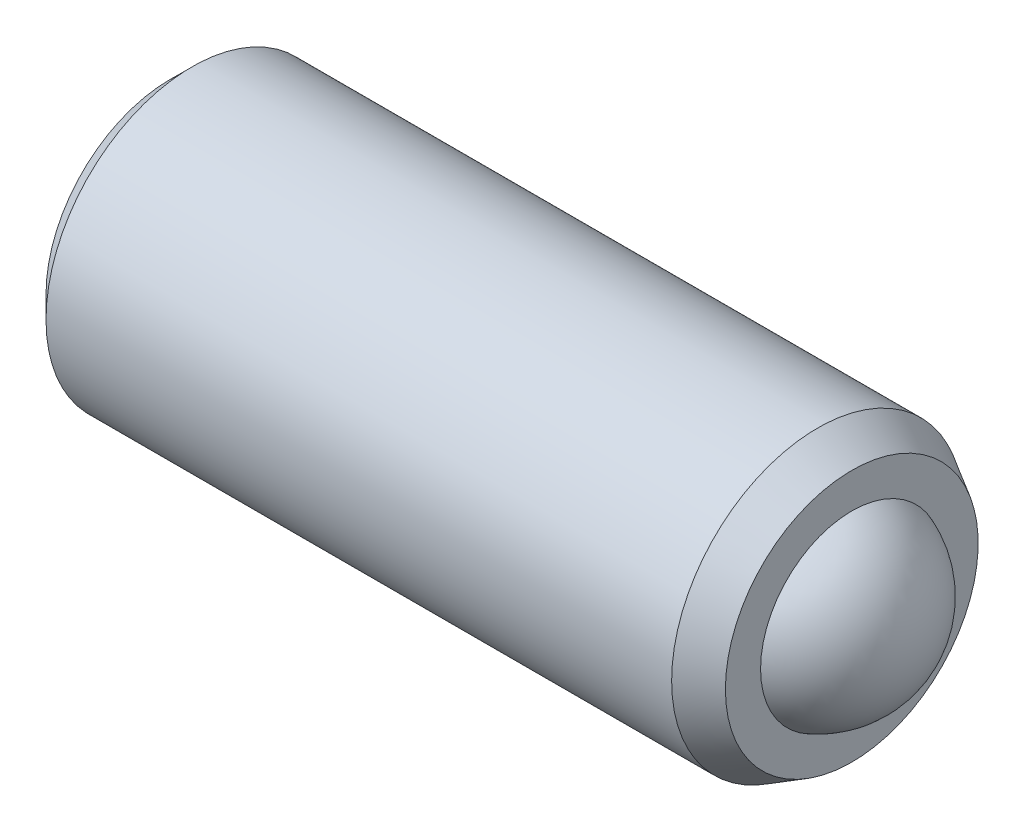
ISO-10303-21;
HEADER;
FILE_DESCRIPTION(('STEP AP214'),'2;1');
FILE_NAME('part.step','',(''),(''),'','','');
FILE_SCHEMA(('AUTOMOTIVE_DESIGN { 1 0 10303 214 1 1 1 1 }'));
ENDSEC;
DATA;
#1=APPLICATION_CONTEXT('core data for automotive mechanical design processes');
#2=APPLICATION_PROTOCOL_DEFINITION('international standard','automotive_design',2000,#1);
#3=PRODUCT_CONTEXT('',#1,'mechanical');
#4=PRODUCT('Part','Part','',(#3));
#5=PRODUCT_RELATED_PRODUCT_CATEGORY('part','',(#4));
#6=PRODUCT_DEFINITION_FORMATION('','',#4);
#7=PRODUCT_DEFINITION_CONTEXT('part definition',#1,'design');
#8=PRODUCT_DEFINITION('design','',#6,#7);
#9=PRODUCT_DEFINITION_SHAPE('','',#8);
#10=(LENGTH_UNIT() NAMED_UNIT(*) SI_UNIT(.MILLI.,.METRE.));
#11=(NAMED_UNIT(*) PLANE_ANGLE_UNIT() SI_UNIT($,.RADIAN.));
#12=(NAMED_UNIT(*) SI_UNIT($,.STERADIAN.) SOLID_ANGLE_UNIT());
#13=UNCERTAINTY_MEASURE_WITH_UNIT(LENGTH_MEASURE(1.E-05),#10,'distance_accuracy_value','');
#14=(GEOMETRIC_REPRESENTATION_CONTEXT(3) GLOBAL_UNCERTAINTY_ASSIGNED_CONTEXT((#13)) GLOBAL_UNIT_ASSIGNED_CONTEXT((#10,
#11,#12)) REPRESENTATION_CONTEXT('',''));
#15=CARTESIAN_POINT('',(0.,0.,0.));
#16=DIRECTION('',(0.,0.,1.));
#17=DIRECTION('',(1.,0.,0.));
#18=AXIS2_PLACEMENT_3D('',#15,#16,#17);
#19=CARTESIAN_POINT('',(6.65,0.,0.));
#20=DIRECTION('',(0.,-1.,0.));
#21=DIRECTION('',(-1.,0.,0.));
#22=AXIS2_PLACEMENT_3D('',#19,#20,#21);
#23=SPHERICAL_SURFACE('',#22,1.);
#24=CARTESIAN_POINT('',(6.65,-1.,0.));
#25=VERTEX_POINT('',#24);
#26=VERTEX_LOOP('',#25);
#27=FACE_BOUND('',#26,.T.);
#28=ADVANCED_FACE('P0_F11',(#27),#23,.T.);
#29=CLOSED_SHELL('',(#28));
#30=MANIFOLD_SOLID_BREP('P0_B1',#29);
#31=CARTESIAN_POINT('',(0.,0.,0.));
#32=DIRECTION('',(1.,0.,0.));
#33=DIRECTION('',(0.,0.,-1.));
#34=AXIS2_PLACEMENT_3D('',#31,#32,#33);
#35=PLANE('',#34);
#36=CARTESIAN_POINT('',(0.,0.,0.));
#37=DIRECTION('',(-1.,0.,0.));
#38=DIRECTION('',(0.,0.,1.));
#39=AXIS2_PLACEMENT_3D('',#36,#37,#38);
#40=CIRCLE('',#39,1.275);
#41=CARTESIAN_POINT('',(0.,0.,1.275));
#42=VERTEX_POINT('',#41);
#43=EDGE_CURVE('P1_E10',#42,#42,#40,.T.);
#44=ORIENTED_EDGE('',*,*,#43,.T.);
#45=EDGE_LOOP('',(#44));
#46=FACE_BOUND('',#45,.T.);
#47=ADVANCED_FACE('P1_F15',(#46),#35,.F.);
#48=CARTESIAN_POINT('',(0.225,0.,0.));
#49=DIRECTION('',(1.,0.,0.));
#50=DIRECTION('',(0.,0.,-1.));
#51=AXIS2_PLACEMENT_3D('',#48,#49,#50);
#52=CONICAL_SURFACE('',#51,1.5,0.78539816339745);
#53=ORIENTED_EDGE('',*,*,#43,.F.);
#54=EDGE_LOOP('',(#53));
#55=FACE_BOUND('',#54,.T.);
#56=CARTESIAN_POINT('',(0.225,0.,0.));
#57=DIRECTION('',(-1.,0.,0.));
#58=DIRECTION('',(0.,0.,1.));
#59=AXIS2_PLACEMENT_3D('',#56,#57,#58);
#60=CIRCLE('',#59,1.5);
#61=CARTESIAN_POINT('',(0.225,0.,1.5));
#62=VERTEX_POINT('',#61);
#63=EDGE_CURVE('P1_E21',#62,#62,#60,.T.);
#64=ORIENTED_EDGE('',*,*,#63,.T.);
#65=EDGE_LOOP('',(#64));
#66=FACE_BOUND('',#65,.T.);
#67=ADVANCED_FACE('P1_F39',(#55,#66),#52,.T.);
#68=CARTESIAN_POINT('',(0.,0.,0.));
#69=DIRECTION('',(-1.,0.,0.));
#70=DIRECTION('',(0.,0.,1.));
#71=AXIS2_PLACEMENT_3D('',#68,#69,#70);
#72=CYLINDRICAL_SURFACE('',#71,1.5);
#73=ORIENTED_EDGE('',*,*,#63,.F.);
#74=EDGE_LOOP('',(#73));
#75=FACE_BOUND('',#74,.T.);
#76=CARTESIAN_POINT('',(6.65,0.,0.));
#77=DIRECTION('',(-1.,0.,0.));
#78=DIRECTION('',(0.,0.,1.));
#79=AXIS2_PLACEMENT_3D('',#76,#77,#78);
#80=CIRCLE('',#79,1.5);
#81=CARTESIAN_POINT('',(6.65,0.,1.5));
#82=VERTEX_POINT('',#81);
#83=EDGE_CURVE('P1_E52',#82,#82,#80,.T.);
#84=ORIENTED_EDGE('',*,*,#83,.T.);
#85=EDGE_LOOP('',(#84));
#86=FACE_BOUND('',#85,.T.);
#87=ADVANCED_FACE('P1_F45',(#75,#86),#72,.T.);
#88=CARTESIAN_POINT('',(7.,0.,0.));
#89=DIRECTION('',(-1.,0.,0.));
#90=DIRECTION('',(0.,0.,1.));
#91=AXIS2_PLACEMENT_3D('',#88,#89,#90);
#92=CONICAL_SURFACE('',#91,1.29792740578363,0.5235987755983);
#93=ORIENTED_EDGE('',*,*,#83,.F.);
#94=EDGE_LOOP('',(#93));
#95=FACE_BOUND('',#94,.T.);
#96=CARTESIAN_POINT('',(7.,0.,0.));
#97=DIRECTION('',(-1.,0.,0.));
#98=DIRECTION('',(0.,0.,1.));
#99=AXIS2_PLACEMENT_3D('',#96,#97,#98);
#100=CIRCLE('',#99,1.29792740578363);
#101=CARTESIAN_POINT('',(7.,0.,1.29792740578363));
#102=VERTEX_POINT('',#101);
#103=EDGE_CURVE('P1_E54',#102,#102,#100,.T.);
#104=ORIENTED_EDGE('',*,*,#103,.T.);
#105=EDGE_LOOP('',(#104));
#106=FACE_BOUND('',#105,.T.);
#107=ADVANCED_FACE('P1_F78',(#95,#106),#92,.T.);
#108=CARTESIAN_POINT('',(7.,1.29792740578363,0.));
#109=DIRECTION('',(-1.,0.,0.));
#110=DIRECTION('',(0.,0.,1.));
#111=AXIS2_PLACEMENT_3D('',#108,#109,#110);
#112=PLANE('',#111);
#113=ORIENTED_EDGE('',*,*,#103,.F.);
#114=EDGE_LOOP('',(#113));
#115=FACE_BOUND('',#114,.T.);
#116=CARTESIAN_POINT('',(7.,0.,0.));
#117=DIRECTION('',(-1.,0.,0.));
#118=DIRECTION('',(0.,0.,1.));
#119=AXIS2_PLACEMENT_3D('',#116,#117,#118);
#120=CIRCLE('',#119,0.936749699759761);
#121=CARTESIAN_POINT('',(7.,0.,0.936749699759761));
#122=VERTEX_POINT('',#121);
#123=EDGE_CURVE('P1_E59',#122,#122,#120,.T.);
#124=ORIENTED_EDGE('',*,*,#123,.T.);
#125=EDGE_LOOP('',(#124));
#126=FACE_BOUND('',#125,.T.);
#127=ADVANCED_FACE('P1_F71',(#115,#126),#112,.F.);
#128=CARTESIAN_POINT('',(6.65,0.,0.));
#129=DIRECTION('',(-1.,0.,0.));
#130=DIRECTION('',(0.,1.,0.));
#131=AXIS2_PLACEMENT_3D('',#128,#129,#130);
#132=SPHERICAL_SURFACE('',#131,1.);
#133=ORIENTED_EDGE('',*,*,#123,.F.);
#134=EDGE_LOOP('',(#133));
#135=FACE_BOUND('',#134,.T.);
#136=CARTESIAN_POINT('',(6.65,0.,0.));
#137=DIRECTION('',(-1.,0.,0.));
#138=DIRECTION('',(0.,0.,1.));
#139=AXIS2_PLACEMENT_3D('',#136,#137,#138);
#140=CIRCLE('',#139,1.);
#141=CARTESIAN_POINT('',(6.65,0.,1.));
#142=VERTEX_POINT('',#141);
#143=EDGE_CURVE('P1_E62',#142,#142,#140,.T.);
#144=ORIENTED_EDGE('',*,*,#143,.T.);
#145=EDGE_LOOP('',(#144));
#146=FACE_BOUND('',#145,.T.);
#147=ADVANCED_FACE('P1_F34',(#135,#146),#132,.F.);
#148=CARTESIAN_POINT('',(0.,0.,0.));
#149=DIRECTION('',(-1.,0.,0.));
#150=DIRECTION('',(0.,0.,1.));
#151=AXIS2_PLACEMENT_3D('',#148,#149,#150);
#152=CYLINDRICAL_SURFACE('',#151,1.);
#153=ORIENTED_EDGE('',*,*,#143,.F.);
#154=EDGE_LOOP('',(#153));
#155=FACE_BOUND('',#154,.T.);
#156=CARTESIAN_POINT('',(1.57735026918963,0.,0.));
#157=DIRECTION('',(-1.,0.,0.));
#158=DIRECTION('',(0.,0.,1.));
#159=AXIS2_PLACEMENT_3D('',#156,#157,#158);
#160=CIRCLE('',#159,1.);
#161=CARTESIAN_POINT('',(1.57735026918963,0.,1.));
#162=VERTEX_POINT('',#161);
#163=EDGE_CURVE('P1_E65',#162,#162,#160,.T.);
#164=ORIENTED_EDGE('',*,*,#163,.T.);
#165=EDGE_LOOP('',(#164));
#166=FACE_BOUND('',#165,.T.);
#167=ADVANCED_FACE('P1_F26',(#155,#166),#152,.F.);
#168=CARTESIAN_POINT('',(1.,0.,0.));
#169=DIRECTION('',(1.,0.,0.));
#170=DIRECTION('',(0.,0.,-1.));
#171=AXIS2_PLACEMENT_3D('',#168,#169,#170);
#172=CONICAL_SURFACE('',#171,0.,1.0471975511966);
#173=ORIENTED_EDGE('',*,*,#163,.F.);
#174=EDGE_LOOP('',(#173));
#175=FACE_BOUND('',#174,.T.);
#176=CARTESIAN_POINT('',(1.,0.,0.));
#177=VERTEX_POINT('',#176);
#178=VERTEX_LOOP('',#177);
#179=FACE_BOUND('',#178,.T.);
#180=ADVANCED_FACE('P1_F24',(#175,#179),#172,.F.);
#181=CLOSED_SHELL('',(#47,#67,#87,#107,#127,#147,#167,#180));
#182=MANIFOLD_SOLID_BREP('P1_B1',#181);
#183=ADVANCED_BREP_SHAPE_REPRESENTATION('',(#18,#30,#182),#14);
#184=SHAPE_DEFINITION_REPRESENTATION(#9,#183);
ENDSEC;
END-ISO-10303-21;
